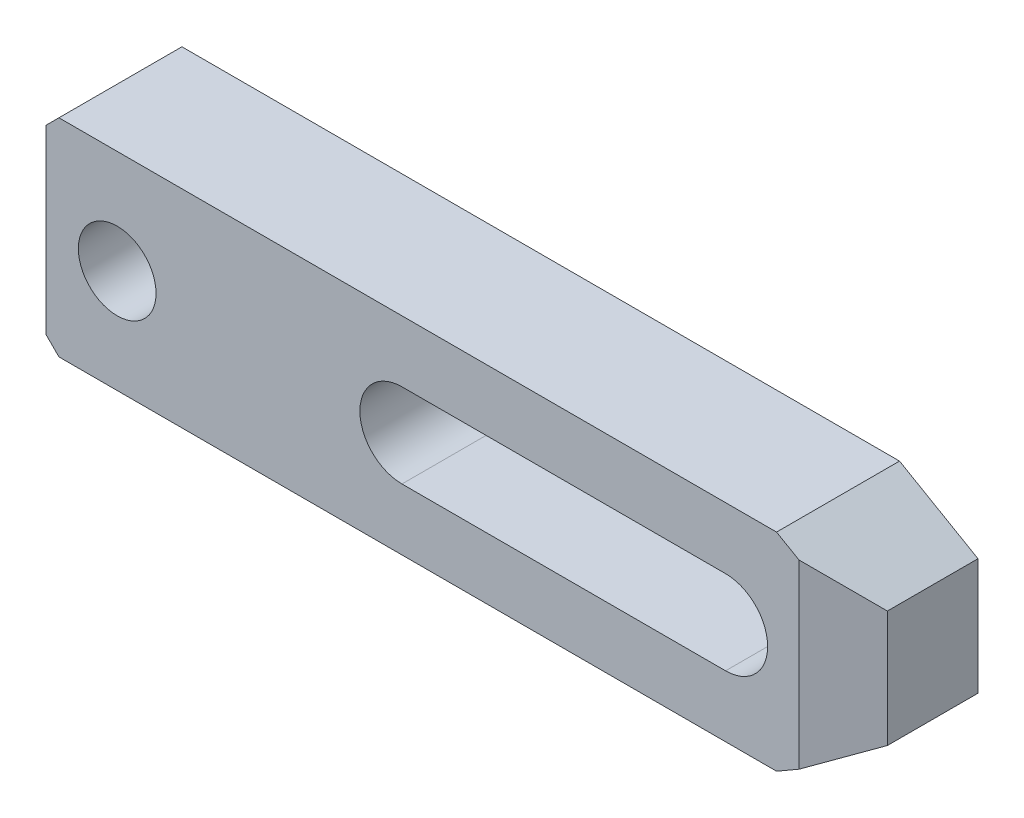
ISO-10303-21;
HEADER;
FILE_DESCRIPTION(('STEP AP214'),'2;1');
FILE_NAME('part.step','',(''),(''),'','','');
FILE_SCHEMA(('AUTOMOTIVE_DESIGN { 1 0 10303 214 1 1 1 1 }'));
ENDSEC;
DATA;
#1=APPLICATION_CONTEXT('core data for automotive mechanical design processes');
#2=APPLICATION_PROTOCOL_DEFINITION('international standard','automotive_design',2000,#1);
#3=PRODUCT_CONTEXT('',#1,'mechanical');
#4=PRODUCT('Part','Part','',(#3));
#5=PRODUCT_RELATED_PRODUCT_CATEGORY('part','',(#4));
#6=PRODUCT_DEFINITION_FORMATION('','',#4);
#7=PRODUCT_DEFINITION_CONTEXT('part definition',#1,'design');
#8=PRODUCT_DEFINITION('design','',#6,#7);
#9=PRODUCT_DEFINITION_SHAPE('','',#8);
#10=(LENGTH_UNIT() NAMED_UNIT(*) SI_UNIT(.MILLI.,.METRE.));
#11=(NAMED_UNIT(*) PLANE_ANGLE_UNIT() SI_UNIT($,.RADIAN.));
#12=(NAMED_UNIT(*) SI_UNIT($,.STERADIAN.) SOLID_ANGLE_UNIT());
#13=UNCERTAINTY_MEASURE_WITH_UNIT(LENGTH_MEASURE(1.E-05),#10,'distance_accuracy_value','');
#14=(GEOMETRIC_REPRESENTATION_CONTEXT(3) GLOBAL_UNCERTAINTY_ASSIGNED_CONTEXT((#13)) GLOBAL_UNIT_ASSIGNED_CONTEXT((#10,
#11,#12)) REPRESENTATION_CONTEXT('',''));
#15=CARTESIAN_POINT('',(0.,0.,0.));
#16=DIRECTION('',(0.,0.,1.));
#17=DIRECTION('',(1.,0.,0.));
#18=AXIS2_PLACEMENT_3D('',#15,#16,#17);
#19=CARTESIAN_POINT('',(-62.4166975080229,56.5833024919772,0.));
#20=DIRECTION('',(0.,0.,1.));
#21=DIRECTION('',(-1.,0.,0.));
#22=AXIS2_PLACEMENT_3D('',#19,#20,#21);
#23=PLANE('',#22);
#24=DIRECTION('',(0.,1.,0.));
#25=VECTOR('',#24,1.);
#26=CARTESIAN_POINT('',(-105.,-14.0000000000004,0.));
#27=LINE('',#26,#25);
#28=CARTESIAN_POINT('',(-105.,-14.0000000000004,0.));
#29=VERTEX_POINT('',#28);
#30=CARTESIAN_POINT('',(-105.,-6.50000000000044,0.));
#31=VERTEX_POINT('',#30);
#32=EDGE_CURVE('E147',#29,#31,#27,.T.);
#33=ORIENTED_EDGE('',*,*,#32,.T.);
#34=DIRECTION('',(-1.,0.,0.));
#35=VECTOR('',#34,1.);
#36=CARTESIAN_POINT('',(0.,-6.4999999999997,0.));
#37=LINE('',#36,#35);
#38=CARTESIAN_POINT('',(0.,-6.4999999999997,0.));
#39=VERTEX_POINT('',#38);
#40=EDGE_CURVE('E237',#39,#31,#37,.T.);
#41=ORIENTED_EDGE('',*,*,#40,.F.);
#42=CARTESIAN_POINT('',(0.,2.96776085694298E-13,0.));
#43=DIRECTION('',(0.,0.,1.));
#44=DIRECTION('',(-1.,0.,0.));
#45=AXIS2_PLACEMENT_3D('',#42,#43,#44);
#46=CIRCLE('',#45,6.5);
#47=CARTESIAN_POINT('',(0.,6.5000000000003,0.));
#48=VERTEX_POINT('',#47);
#49=EDGE_CURVE('E129',#39,#48,#46,.T.);
#50=ORIENTED_EDGE('',*,*,#49,.T.);
#51=DIRECTION('',(1.,0.,0.));
#52=VECTOR('',#51,1.);
#53=CARTESIAN_POINT('',(-50.,6.5,0.));
#54=LINE('',#53,#52);
#55=CARTESIAN_POINT('',(-105.,6.49999999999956,0.));
#56=VERTEX_POINT('',#55);
#57=EDGE_CURVE('E120',#56,#48,#54,.T.);
#58=ORIENTED_EDGE('',*,*,#57,.F.);
#59=CARTESIAN_POINT('',(-105.,13.9999999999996,0.));
#60=VERTEX_POINT('',#59);
#61=EDGE_CURVE('E125',#56,#60,#27,.T.);
#62=ORIENTED_EDGE('',*,*,#61,.T.);
#63=DIRECTION('',(-0.707106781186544,-0.707106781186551,0.));
#64=VECTOR('',#63,1.);
#65=CARTESIAN_POINT('',(-103.,15.9999999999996,0.));
#66=LINE('',#65,#64);
#67=CARTESIAN_POINT('',(-103.,15.9999999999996,0.));
#68=VERTEX_POINT('',#67);
#69=EDGE_CURVE('E148',#68,#60,#66,.T.);
#70=ORIENTED_EDGE('',*,*,#69,.F.);
#71=DIRECTION('',(-1.,0.,0.));
#72=VECTOR('',#71,1.);
#73=CARTESIAN_POINT('',(7.8756443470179,16.0000000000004,0.));
#74=LINE('',#73,#72);
#75=CARTESIAN_POINT('',(7.8756443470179,16.0000000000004,0.));
#76=VERTEX_POINT('',#75);
#77=EDGE_CURVE('E151',#76,#68,#74,.T.);
#78=ORIENTED_EDGE('',*,*,#77,.F.);
#79=DIRECTION('',(-0.866025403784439,0.499999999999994,0.));
#80=VECTOR('',#79,1.);
#81=CARTESIAN_POINT('',(20.,9.00000000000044,0.));
#82=LINE('',#81,#80);
#83=CARTESIAN_POINT('',(20.,9.00000000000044,0.));
#84=VERTEX_POINT('',#83);
#85=EDGE_CURVE('E158',#84,#76,#82,.T.);
#86=ORIENTED_EDGE('',*,*,#85,.F.);
#87=DIRECTION('',(0.,-1.,0.));
#88=VECTOR('',#87,1.);
#89=CARTESIAN_POINT('',(20.,9.00000000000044,0.));
#90=LINE('',#89,#88);
#91=CARTESIAN_POINT('',(20.,-8.99999999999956,0.));
#92=VERTEX_POINT('',#91);
#93=EDGE_CURVE('E181',#84,#92,#90,.T.);
#94=ORIENTED_EDGE('',*,*,#93,.T.);
#95=DIRECTION('',(-0.866025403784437,-0.500000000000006,0.));
#96=VECTOR('',#95,1.);
#97=CARTESIAN_POINT('',(20.,-8.99999999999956,0.));
#98=LINE('',#97,#96);
#99=CARTESIAN_POINT('',(7.8756443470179,-15.9999999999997,0.));
#100=VERTEX_POINT('',#99);
#101=EDGE_CURVE('E208',#92,#100,#98,.T.);
#102=ORIENTED_EDGE('',*,*,#101,.T.);
#103=DIRECTION('',(-1.,0.,0.));
#104=VECTOR('',#103,1.);
#105=CARTESIAN_POINT('',(7.8756443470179,-15.9999999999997,0.));
#106=LINE('',#105,#104);
#107=CARTESIAN_POINT('',(-103.,-16.0000000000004,0.));
#108=VERTEX_POINT('',#107);
#109=EDGE_CURVE('E210',#100,#108,#106,.T.);
#110=ORIENTED_EDGE('',*,*,#109,.T.);
#111=DIRECTION('',(-0.707106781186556,0.707106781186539,0.));
#112=VECTOR('',#111,1.);
#113=CARTESIAN_POINT('',(-103.,-16.0000000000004,0.));
#114=LINE('',#113,#112);
#115=EDGE_CURVE('E150',#108,#29,#114,.T.);
#116=ORIENTED_EDGE('',*,*,#115,.T.);
#117=EDGE_LOOP('',(#33,#41,#50,#58,#62,#70,#78,#86,#94,#102,#110,#116));
#118=FACE_BOUND('',#117,.T.);
#119=ADVANCED_FACE('F14',(#118),#23,.F.);
#120=CARTESIAN_POINT('',(-105.,-14.0000000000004,19.));
#121=DIRECTION('',(-1.,0.,0.));
#122=DIRECTION('',(0.,0.,-1.));
#123=AXIS2_PLACEMENT_3D('',#120,#121,#122);
#124=PLANE('',#123);
#125=DIRECTION('',(0.,-1.,0.));
#126=VECTOR('',#125,1.);
#127=CARTESIAN_POINT('',(-105.,-14.0000000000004,5.));
#128=LINE('',#127,#126);
#129=CARTESIAN_POINT('',(-105.,6.49999999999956,5.));
#130=VERTEX_POINT('',#129);
#131=CARTESIAN_POINT('',(-105.,-6.50000000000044,5.));
#132=VERTEX_POINT('',#131);
#133=EDGE_CURVE('E141',#130,#132,#128,.T.);
#134=ORIENTED_EDGE('',*,*,#133,.T.);
#135=DIRECTION('',(0.,0.,-1.));
#136=VECTOR('',#135,1.);
#137=CARTESIAN_POINT('',(-105.,-6.50000000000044,19.));
#138=LINE('',#137,#136);
#139=EDGE_CURVE('E140',#132,#31,#138,.T.);
#140=ORIENTED_EDGE('',*,*,#139,.T.);
#141=ORIENTED_EDGE('',*,*,#32,.F.);
#142=DIRECTION('',(0.,0.,-1.));
#143=VECTOR('',#142,1.);
#144=CARTESIAN_POINT('',(-105.,-14.0000000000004,19.));
#145=LINE('',#144,#143);
#146=CARTESIAN_POINT('',(-105.,-14.0000000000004,19.));
#147=VERTEX_POINT('',#146);
#148=EDGE_CURVE('E189',#147,#29,#145,.T.);
#149=ORIENTED_EDGE('',*,*,#148,.F.);
#150=DIRECTION('',(0.,1.,0.));
#151=VECTOR('',#150,1.);
#152=CARTESIAN_POINT('',(-105.,-14.0000000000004,19.));
#153=LINE('',#152,#151);
#154=CARTESIAN_POINT('',(-105.,13.9999999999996,19.));
#155=VERTEX_POINT('',#154);
#156=EDGE_CURVE('E171',#147,#155,#153,.T.);
#157=ORIENTED_EDGE('',*,*,#156,.T.);
#158=DIRECTION('',(0.,0.,-1.));
#159=VECTOR('',#158,1.);
#160=CARTESIAN_POINT('',(-105.,13.9999999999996,19.));
#161=LINE('',#160,#159);
#162=EDGE_CURVE('E145',#155,#60,#161,.T.);
#163=ORIENTED_EDGE('',*,*,#162,.T.);
#164=ORIENTED_EDGE('',*,*,#61,.F.);
#165=DIRECTION('',(0.,0.,-1.));
#166=VECTOR('',#165,1.);
#167=CARTESIAN_POINT('',(-105.,6.49999999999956,19.));
#168=LINE('',#167,#166);
#169=EDGE_CURVE('E135',#130,#56,#168,.T.);
#170=ORIENTED_EDGE('',*,*,#169,.F.);
#171=EDGE_LOOP('',(#134,#140,#141,#149,#157,#163,#164,#170));
#172=FACE_BOUND('',#171,.T.);
#173=ADVANCED_FACE('F143',(#172),#124,.T.);
#174=CARTESIAN_POINT('',(-94.,-3.47499996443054E-13,19.));
#175=DIRECTION('',(0.,0.,-1.));
#176=DIRECTION('',(1.,0.,0.));
#177=AXIS2_PLACEMENT_3D('',#174,#175,#176);
#178=CYLINDRICAL_SURFACE('',#177,6.);
#179=CARTESIAN_POINT('',(-94.,-3.47499996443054E-13,19.));
#180=DIRECTION('',(0.,0.,1.));
#181=DIRECTION('',(-1.,0.,0.));
#182=AXIS2_PLACEMENT_3D('',#179,#180,#181);
#183=CIRCLE('',#182,6.);
#184=CARTESIAN_POINT('',(-100.,-3.89397796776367E-13,19.));
#185=VERTEX_POINT('',#184);
#186=EDGE_CURVE('E161',#185,#185,#183,.T.);
#187=ORIENTED_EDGE('',*,*,#186,.T.);
#188=EDGE_LOOP('',(#187));
#189=FACE_BOUND('',#188,.T.);
#190=CARTESIAN_POINT('',(-94.,-3.47499996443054E-13,5.));
#191=DIRECTION('',(0.,0.,-1.));
#192=DIRECTION('',(1.,0.,0.));
#193=AXIS2_PLACEMENT_3D('',#190,#191,#192);
#194=CIRCLE('',#193,6.);
#195=CARTESIAN_POINT('',(-88.,-3.05602196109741E-13,5.));
#196=VERTEX_POINT('',#195);
#197=EDGE_CURVE('E400',#196,#196,#194,.T.);
#198=ORIENTED_EDGE('',*,*,#197,.T.);
#199=EDGE_LOOP('',(#198));
#200=FACE_BOUND('',#199,.T.);
#201=ADVANCED_FACE('F262',(#189,#200),#178,.F.);
#202=CARTESIAN_POINT('',(-50.,0.,19.));
#203=DIRECTION('',(0.,0.,-1.));
#204=DIRECTION('',(1.,0.,0.));
#205=AXIS2_PLACEMENT_3D('',#202,#203,#204);
#206=CYLINDRICAL_SURFACE('',#205,6.5);
#207=DIRECTION('',(0.,0.,-1.));
#208=VECTOR('',#207,1.);
#209=CARTESIAN_POINT('',(-50.,-6.5,19.));
#210=LINE('',#209,#208);
#211=CARTESIAN_POINT('',(-50.,-6.5,19.));
#212=VERTEX_POINT('',#211);
#213=CARTESIAN_POINT('',(-50.,-6.5,5.));
#214=VERTEX_POINT('',#213);
#215=EDGE_CURVE('E256',#212,#214,#210,.T.);
#216=ORIENTED_EDGE('',*,*,#215,.T.);
#217=CARTESIAN_POINT('',(-50.,0.,5.));
#218=DIRECTION('',(0.,0.,-1.));
#219=DIRECTION('',(1.,0.,0.));
#220=AXIS2_PLACEMENT_3D('',#217,#218,#219);
#221=CIRCLE('',#220,6.5);
#222=CARTESIAN_POINT('',(-50.,6.5,5.));
#223=VERTEX_POINT('',#222);
#224=EDGE_CURVE('E278',#214,#223,#221,.T.);
#225=ORIENTED_EDGE('',*,*,#224,.T.);
#226=DIRECTION('',(0.,0.,-1.));
#227=VECTOR('',#226,1.);
#228=CARTESIAN_POINT('',(-50.,6.5,19.));
#229=LINE('',#228,#227);
#230=CARTESIAN_POINT('',(-50.,6.5,19.));
#231=VERTEX_POINT('',#230);
#232=EDGE_CURVE('E244',#231,#223,#229,.T.);
#233=ORIENTED_EDGE('',*,*,#232,.F.);
#234=CARTESIAN_POINT('',(-50.,0.,19.));
#235=DIRECTION('',(0.,0.,1.));
#236=DIRECTION('',(-1.,0.,0.));
#237=AXIS2_PLACEMENT_3D('',#234,#235,#236);
#238=CIRCLE('',#237,6.5);
#239=EDGE_CURVE('E132',#231,#212,#238,.T.);
#240=ORIENTED_EDGE('',*,*,#239,.T.);
#241=EDGE_LOOP('',(#216,#225,#233,#240));
#242=FACE_BOUND('',#241,.T.);
#243=ADVANCED_FACE('F269',(#242),#206,.F.);
#244=CARTESIAN_POINT('',(-62.4166975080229,56.5833024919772,19.));
#245=DIRECTION('',(0.,0.,1.));
#246=DIRECTION('',(-1.,0.,0.));
#247=AXIS2_PLACEMENT_3D('',#244,#245,#246);
#248=PLANE('',#247);
#249=DIRECTION('',(0.,-1.,0.));
#250=VECTOR('',#249,1.);
#251=CARTESIAN_POINT('',(11.3397459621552,56.5833024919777,19.));
#252=LINE('',#251,#250);
#253=CARTESIAN_POINT('',(11.3397459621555,14.0000000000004,19.));
#254=VERTEX_POINT('',#253);
#255=CARTESIAN_POINT('',(11.3397459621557,-13.9999999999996,19.));
#256=VERTEX_POINT('',#255);
#257=EDGE_CURVE('E233',#254,#256,#252,.T.);
#258=ORIENTED_EDGE('',*,*,#257,.F.);
#259=DIRECTION('',(-0.866025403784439,0.499999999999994,0.));
#260=VECTOR('',#259,1.);
#261=CARTESIAN_POINT('',(20.,9.00000000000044,19.));
#262=LINE('',#261,#260);
#263=CARTESIAN_POINT('',(7.8756443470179,16.0000000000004,19.));
#264=VERTEX_POINT('',#263);
#265=EDGE_CURVE('E179',#254,#264,#262,.T.);
#266=ORIENTED_EDGE('',*,*,#265,.T.);
#267=DIRECTION('',(-1.,0.,0.));
#268=VECTOR('',#267,1.);
#269=CARTESIAN_POINT('',(7.8756443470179,16.0000000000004,19.));
#270=LINE('',#269,#268);
#271=CARTESIAN_POINT('',(-103.,15.9999999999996,19.));
#272=VERTEX_POINT('',#271);
#273=EDGE_CURVE('E176',#264,#272,#270,.T.);
#274=ORIENTED_EDGE('',*,*,#273,.T.);
#275=DIRECTION('',(-0.707106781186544,-0.707106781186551,0.));
#276=VECTOR('',#275,1.);
#277=CARTESIAN_POINT('',(-103.,15.9999999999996,19.));
#278=LINE('',#277,#276);
#279=EDGE_CURVE('E173',#272,#155,#278,.T.);
#280=ORIENTED_EDGE('',*,*,#279,.T.);
#281=ORIENTED_EDGE('',*,*,#156,.F.);
#282=DIRECTION('',(-0.707106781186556,0.707106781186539,0.));
#283=VECTOR('',#282,1.);
#284=CARTESIAN_POINT('',(-103.,-16.0000000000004,19.));
#285=LINE('',#284,#283);
#286=CARTESIAN_POINT('',(-103.,-16.0000000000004,19.));
#287=VERTEX_POINT('',#286);
#288=EDGE_CURVE('E168',#287,#147,#285,.T.);
#289=ORIENTED_EDGE('',*,*,#288,.F.);
#290=DIRECTION('',(-1.,0.,0.));
#291=VECTOR('',#290,1.);
#292=CARTESIAN_POINT('',(7.8756443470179,-15.9999999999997,19.));
#293=LINE('',#292,#291);
#294=CARTESIAN_POINT('',(7.8756443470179,-15.9999999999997,19.));
#295=VERTEX_POINT('',#294);
#296=EDGE_CURVE('E165',#295,#287,#293,.T.);
#297=ORIENTED_EDGE('',*,*,#296,.F.);
#298=DIRECTION('',(-0.866025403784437,-0.500000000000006,0.));
#299=VECTOR('',#298,1.);
#300=CARTESIAN_POINT('',(20.,-8.99999999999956,19.));
#301=LINE('',#300,#299);
#302=EDGE_CURVE('E162',#256,#295,#301,.T.);
#303=ORIENTED_EDGE('',*,*,#302,.F.);
#304=EDGE_LOOP('',(#258,#266,#274,#280,#281,#289,#297,#303));
#305=FACE_BOUND('',#304,.T.);
#306=ORIENTED_EDGE('',*,*,#186,.F.);
#307=EDGE_LOOP('',(#306));
#308=FACE_BOUND('',#307,.T.);
#309=DIRECTION('',(-1.,0.,0.));
#310=VECTOR('',#309,1.);
#311=CARTESIAN_POINT('',(0.,-6.4999999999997,19.));
#312=LINE('',#311,#310);
#313=CARTESIAN_POINT('',(0.,-6.4999999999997,19.));
#314=VERTEX_POINT('',#313);
#315=EDGE_CURVE('E247',#314,#212,#312,.T.);
#316=ORIENTED_EDGE('',*,*,#315,.T.);
#317=ORIENTED_EDGE('',*,*,#239,.F.);
#318=DIRECTION('',(1.,0.,0.));
#319=VECTOR('',#318,1.);
#320=CARTESIAN_POINT('',(-50.,6.5,19.));
#321=LINE('',#320,#319);
#322=CARTESIAN_POINT('',(0.,6.5000000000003,19.));
#323=VERTEX_POINT('',#322);
#324=EDGE_CURVE('E241',#231,#323,#321,.T.);
#325=ORIENTED_EDGE('',*,*,#324,.T.);
#326=CARTESIAN_POINT('',(0.,2.96776085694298E-13,19.));
#327=DIRECTION('',(0.,0.,1.));
#328=DIRECTION('',(-1.,0.,0.));
#329=AXIS2_PLACEMENT_3D('',#326,#327,#328);
#330=CIRCLE('',#329,6.5);
#331=EDGE_CURVE('E245',#314,#323,#330,.T.);
#332=ORIENTED_EDGE('',*,*,#331,.F.);
#333=EDGE_LOOP('',(#316,#317,#325,#332));
#334=FACE_BOUND('',#333,.T.);
#335=ADVANCED_FACE('F265',(#305,#308,#334),#248,.T.);
#336=CARTESIAN_POINT('',(20.,9.00000000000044,19.));
#337=DIRECTION('',(-0.499999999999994,-0.866025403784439,0.));
#338=DIRECTION('',(0.86602540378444,-0.499999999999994,0.));
#339=AXIS2_PLACEMENT_3D('',#336,#337,#338);
#340=PLANE('',#339);
#341=ORIENTED_EDGE('',*,*,#265,.F.);
#342=DIRECTION('',(0.774596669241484,-0.447213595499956,-0.447213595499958));
#343=VECTOR('',#342,1.);
#344=CARTESIAN_POINT('',(18.267949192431,10.0000000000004,15.));
#345=LINE('',#344,#343);
#346=CARTESIAN_POINT('',(20.,9.00000000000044,14.));
#347=VERTEX_POINT('',#346);
#348=EDGE_CURVE('E235',#254,#347,#345,.T.);
#349=ORIENTED_EDGE('',*,*,#348,.T.);
#350=DIRECTION('',(0.,0.,-1.));
#351=VECTOR('',#350,1.);
#352=CARTESIAN_POINT('',(20.,9.00000000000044,19.));
#353=LINE('',#352,#351);
#354=EDGE_CURVE('E164',#347,#84,#353,.T.);
#355=ORIENTED_EDGE('',*,*,#354,.T.);
#356=ORIENTED_EDGE('',*,*,#85,.T.);
#357=DIRECTION('',(0.,0.,-1.));
#358=VECTOR('',#357,1.);
#359=CARTESIAN_POINT('',(7.8756443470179,16.0000000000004,19.));
#360=LINE('',#359,#358);
#361=EDGE_CURVE('E9',#264,#76,#360,.T.);
#362=ORIENTED_EDGE('',*,*,#361,.F.);
#363=EDGE_LOOP('',(#341,#349,#355,#356,#362));
#364=FACE_BOUND('',#363,.T.);
#365=ADVANCED_FACE('F268',(#364),#340,.F.);
#366=CARTESIAN_POINT('',(7.8756443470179,16.0000000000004,19.));
#367=DIRECTION('',(0.,-1.,0.));
#368=DIRECTION('',(0.,0.,1.));
#369=AXIS2_PLACEMENT_3D('',#366,#367,#368);
#370=PLANE('',#369);
#371=DIRECTION('',(0.,0.,-1.));
#372=VECTOR('',#371,1.);
#373=CARTESIAN_POINT('',(-103.,15.9999999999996,19.));
#374=LINE('',#373,#372);
#375=EDGE_CURVE('E22',#272,#68,#374,.T.);
#376=ORIENTED_EDGE('',*,*,#375,.F.);
#377=ORIENTED_EDGE('',*,*,#273,.F.);
#378=ORIENTED_EDGE('',*,*,#361,.T.);
#379=ORIENTED_EDGE('',*,*,#77,.T.);
#380=EDGE_LOOP('',(#376,#377,#378,#379));
#381=FACE_BOUND('',#380,.T.);
#382=ADVANCED_FACE('F16',(#381),#370,.F.);
#383=CARTESIAN_POINT('',(-103.,15.9999999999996,19.));
#384=DIRECTION('',(0.707106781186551,-0.707106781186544,0.));
#385=DIRECTION('',(0.707106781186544,0.707106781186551,0.));
#386=AXIS2_PLACEMENT_3D('',#383,#384,#385);
#387=PLANE('',#386);
#388=ORIENTED_EDGE('',*,*,#162,.F.);
#389=ORIENTED_EDGE('',*,*,#279,.F.);
#390=ORIENTED_EDGE('',*,*,#375,.T.);
#391=ORIENTED_EDGE('',*,*,#69,.T.);
#392=EDGE_LOOP('',(#388,#389,#390,#391));
#393=FACE_BOUND('',#392,.T.);
#394=ADVANCED_FACE('F193',(#393),#387,.F.);
#395=CARTESIAN_POINT('',(-103.,-16.0000000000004,19.));
#396=DIRECTION('',(-0.707106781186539,-0.707106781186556,0.));
#397=DIRECTION('',(0.707106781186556,-0.707106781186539,0.));
#398=AXIS2_PLACEMENT_3D('',#395,#396,#397);
#399=PLANE('',#398);
#400=DIRECTION('',(0.,0.,-1.));
#401=VECTOR('',#400,1.);
#402=CARTESIAN_POINT('',(-103.,-16.0000000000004,19.));
#403=LINE('',#402,#401);
#404=EDGE_CURVE('E187',#287,#108,#403,.T.);
#405=ORIENTED_EDGE('',*,*,#404,.F.);
#406=ORIENTED_EDGE('',*,*,#288,.T.);
#407=ORIENTED_EDGE('',*,*,#148,.T.);
#408=ORIENTED_EDGE('',*,*,#115,.F.);
#409=EDGE_LOOP('',(#405,#406,#407,#408));
#410=FACE_BOUND('',#409,.T.);
#411=ADVANCED_FACE('F220',(#410),#399,.T.);
#412=CARTESIAN_POINT('',(7.8756443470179,-15.9999999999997,19.));
#413=DIRECTION('',(0.,-1.,0.));
#414=DIRECTION('',(0.,0.,1.));
#415=AXIS2_PLACEMENT_3D('',#412,#413,#414);
#416=PLANE('',#415);
#417=DIRECTION('',(0.,0.,-1.));
#418=VECTOR('',#417,1.);
#419=CARTESIAN_POINT('',(7.8756443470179,-15.9999999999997,19.));
#420=LINE('',#419,#418);
#421=EDGE_CURVE('E185',#295,#100,#420,.T.);
#422=ORIENTED_EDGE('',*,*,#421,.F.);
#423=ORIENTED_EDGE('',*,*,#296,.T.);
#424=ORIENTED_EDGE('',*,*,#404,.T.);
#425=ORIENTED_EDGE('',*,*,#109,.F.);
#426=EDGE_LOOP('',(#422,#423,#424,#425));
#427=FACE_BOUND('',#426,.T.);
#428=ADVANCED_FACE('F308',(#427),#416,.T.);
#429=CARTESIAN_POINT('',(20.,-8.99999999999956,19.));
#430=DIRECTION('',(0.500000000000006,-0.866025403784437,0.));
#431=DIRECTION('',(0.866025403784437,0.500000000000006,0.));
#432=AXIS2_PLACEMENT_3D('',#429,#430,#431);
#433=PLANE('',#432);
#434=DIRECTION('',(0.774596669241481,0.447213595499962,-0.44721359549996));
#435=VECTOR('',#434,1.);
#436=CARTESIAN_POINT('',(18.2679491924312,-9.99999999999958,15.));
#437=LINE('',#436,#435);
#438=CARTESIAN_POINT('',(20.,-8.99999999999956,14.));
#439=VERTEX_POINT('',#438);
#440=EDGE_CURVE('E37',#256,#439,#437,.T.);
#441=ORIENTED_EDGE('',*,*,#440,.F.);
#442=ORIENTED_EDGE('',*,*,#302,.T.);
#443=ORIENTED_EDGE('',*,*,#421,.T.);
#444=ORIENTED_EDGE('',*,*,#101,.F.);
#445=DIRECTION('',(0.,0.,-1.));
#446=VECTOR('',#445,1.);
#447=CARTESIAN_POINT('',(20.,-8.99999999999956,19.));
#448=LINE('',#447,#446);
#449=EDGE_CURVE('E183',#439,#92,#448,.T.);
#450=ORIENTED_EDGE('',*,*,#449,.F.);
#451=EDGE_LOOP('',(#441,#442,#443,#444,#450));
#452=FACE_BOUND('',#451,.T.);
#453=ADVANCED_FACE('F305',(#452),#433,.T.);
#454=CARTESIAN_POINT('',(20.,9.00000000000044,19.));
#455=DIRECTION('',(1.,0.,0.));
#456=DIRECTION('',(0.,0.,1.));
#457=AXIS2_PLACEMENT_3D('',#454,#455,#456);
#458=PLANE('',#457);
#459=DIRECTION('',(0.,-1.,0.));
#460=VECTOR('',#459,1.);
#461=CARTESIAN_POINT('',(20.,20.0000000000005,14.));
#462=LINE('',#461,#460);
#463=EDGE_CURVE('E227',#347,#439,#462,.T.);
#464=ORIENTED_EDGE('',*,*,#463,.T.);
#465=ORIENTED_EDGE('',*,*,#449,.T.);
#466=ORIENTED_EDGE('',*,*,#93,.F.);
#467=ORIENTED_EDGE('',*,*,#354,.F.);
#468=EDGE_LOOP('',(#464,#465,#466,#467));
#469=FACE_BOUND('',#468,.T.);
#470=ADVANCED_FACE('F205',(#469),#458,.T.);
#471=CARTESIAN_POINT('',(0.,-6.4999999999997,19.));
#472=DIRECTION('',(0.,-1.,0.));
#473=DIRECTION('',(1.,0.,0.));
#474=AXIS2_PLACEMENT_3D('',#471,#472,#473);
#475=PLANE('',#474);
#476=ORIENTED_EDGE('',*,*,#40,.T.);
#477=ORIENTED_EDGE('',*,*,#139,.F.);
#478=DIRECTION('',(1.,0.,0.));
#479=VECTOR('',#478,1.);
#480=CARTESIAN_POINT('',(-110.,-6.50000000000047,5.));
#481=LINE('',#480,#479);
#482=EDGE_CURVE('E276',#132,#214,#481,.T.);
#483=ORIENTED_EDGE('',*,*,#482,.T.);
#484=ORIENTED_EDGE('',*,*,#215,.F.);
#485=ORIENTED_EDGE('',*,*,#315,.F.);
#486=DIRECTION('',(0.,0.,-1.));
#487=VECTOR('',#486,1.);
#488=CARTESIAN_POINT('',(0.,-6.4999999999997,19.));
#489=LINE('',#488,#487);
#490=EDGE_CURVE('E255',#314,#39,#489,.T.);
#491=ORIENTED_EDGE('',*,*,#490,.T.);
#492=EDGE_LOOP('',(#476,#477,#483,#484,#485,#491));
#493=FACE_BOUND('',#492,.T.);
#494=ADVANCED_FACE('F275',(#493),#475,.F.);
#495=CARTESIAN_POINT('',(0.,2.96776085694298E-13,19.));
#496=DIRECTION('',(0.,0.,-1.));
#497=DIRECTION('',(1.,0.,0.));
#498=AXIS2_PLACEMENT_3D('',#495,#496,#497);
#499=CYLINDRICAL_SURFACE('',#498,6.5);
#500=DIRECTION('',(0.,0.,-1.));
#501=VECTOR('',#500,1.);
#502=CARTESIAN_POINT('',(0.,6.5000000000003,19.));
#503=LINE('',#502,#501);
#504=EDGE_CURVE('E253',#323,#48,#503,.T.);
#505=ORIENTED_EDGE('',*,*,#504,.T.);
#506=ORIENTED_EDGE('',*,*,#49,.F.);
#507=ORIENTED_EDGE('',*,*,#490,.F.);
#508=ORIENTED_EDGE('',*,*,#331,.T.);
#509=EDGE_LOOP('',(#505,#506,#507,#508));
#510=FACE_BOUND('',#509,.T.);
#511=ADVANCED_FACE('F280',(#510),#499,.F.);
#512=CARTESIAN_POINT('',(-50.,6.5,19.));
#513=DIRECTION('',(0.,1.,0.));
#514=DIRECTION('',(-1.,0.,0.));
#515=AXIS2_PLACEMENT_3D('',#512,#513,#514);
#516=PLANE('',#515);
#517=ORIENTED_EDGE('',*,*,#57,.T.);
#518=ORIENTED_EDGE('',*,*,#504,.F.);
#519=ORIENTED_EDGE('',*,*,#324,.F.);
#520=ORIENTED_EDGE('',*,*,#232,.T.);
#521=DIRECTION('',(1.,0.,0.));
#522=VECTOR('',#521,1.);
#523=CARTESIAN_POINT('',(-110.,6.49999999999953,5.));
#524=LINE('',#523,#522);
#525=EDGE_CURVE('E29',#130,#223,#524,.T.);
#526=ORIENTED_EDGE('',*,*,#525,.F.);
#527=ORIENTED_EDGE('',*,*,#169,.T.);
#528=EDGE_LOOP('',(#517,#518,#519,#520,#526,#527));
#529=FACE_BOUND('',#528,.T.);
#530=ADVANCED_FACE('F136',(#529),#516,.F.);
#531=CARTESIAN_POINT('',(7.8756443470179,20.0000000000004,21.));
#532=DIRECTION('',(-0.5,0.,-0.866025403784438));
#533=DIRECTION('',(0.866025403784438,0.,-0.5));
#534=AXIS2_PLACEMENT_3D('',#531,#532,#533);
#535=PLANE('',#534);
#536=ORIENTED_EDGE('',*,*,#257,.T.);
#537=ORIENTED_EDGE('',*,*,#440,.T.);
#538=ORIENTED_EDGE('',*,*,#463,.F.);
#539=ORIENTED_EDGE('',*,*,#348,.F.);
#540=EDGE_LOOP('',(#536,#537,#538,#539));
#541=FACE_BOUND('',#540,.T.);
#542=ADVANCED_FACE('F289',(#541),#535,.F.);
#543=CARTESIAN_POINT('',(-110.,-6.50000000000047,5.));
#544=DIRECTION('',(0.,0.,-1.));
#545=DIRECTION('',(1.,0.,0.));
#546=AXIS2_PLACEMENT_3D('',#543,#544,#545);
#547=PLANE('',#546);
#548=ORIENTED_EDGE('',*,*,#197,.F.);
#549=EDGE_LOOP('',(#548));
#550=FACE_BOUND('',#549,.T.);
#551=ORIENTED_EDGE('',*,*,#525,.T.);
#552=ORIENTED_EDGE('',*,*,#224,.F.);
#553=ORIENTED_EDGE('',*,*,#482,.F.);
#554=ORIENTED_EDGE('',*,*,#133,.F.);
#555=EDGE_LOOP('',(#551,#552,#553,#554));
#556=FACE_BOUND('',#555,.T.);
#557=ADVANCED_FACE('F386',(#550,#556),#547,.T.);
#558=CLOSED_SHELL('',(#119,#173,#201,#243,#335,#365,#382,#394,#411,#428,#453,#470,#494,#511,
#530,#542,#557));
#559=MANIFOLD_SOLID_BREP('B1',#558);
#560=ADVANCED_BREP_SHAPE_REPRESENTATION('',(#18,#559),#14);
#561=SHAPE_DEFINITION_REPRESENTATION(#9,#560);
ENDSEC;
END-ISO-10303-21;
